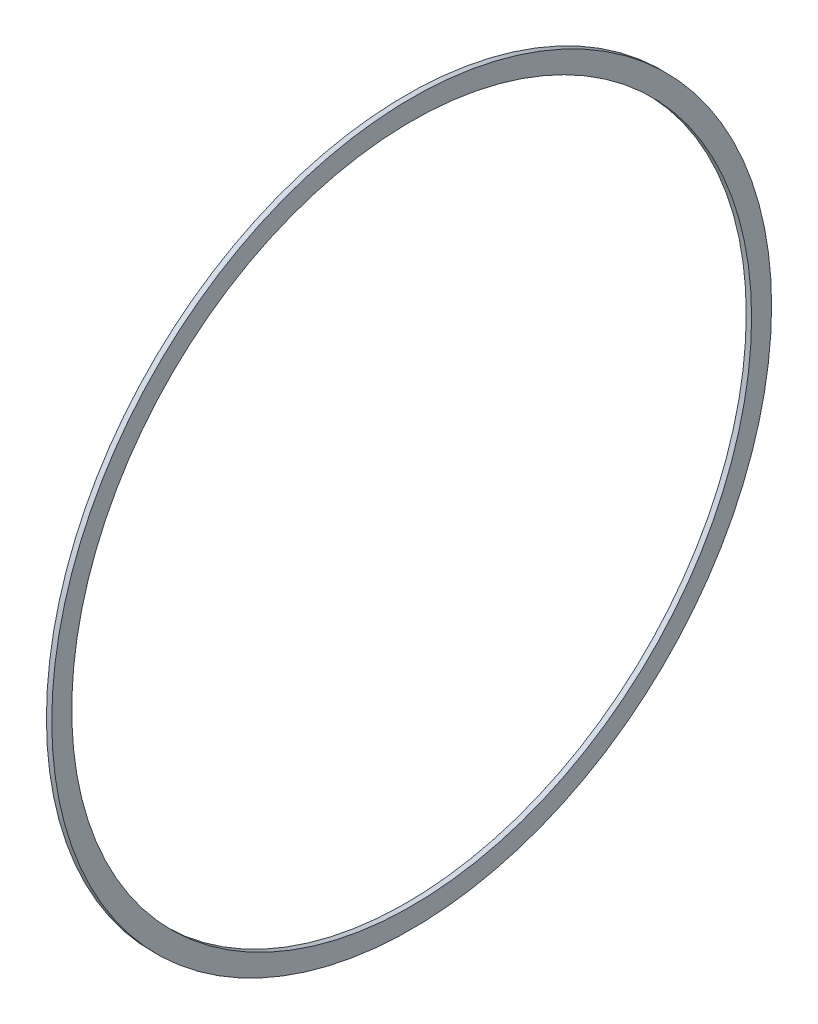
ISO-10303-21;
HEADER;
FILE_DESCRIPTION(('STEP AP214'),'2;1');
FILE_NAME('part.step','',(''),(''),'','','');
FILE_SCHEMA(('AUTOMOTIVE_DESIGN { 1 0 10303 214 1 1 1 1 }'));
ENDSEC;
DATA;
#1=APPLICATION_CONTEXT('core data for automotive mechanical design processes');
#2=APPLICATION_PROTOCOL_DEFINITION('international standard','automotive_design',2000,#1);
#3=PRODUCT_CONTEXT('',#1,'mechanical');
#4=PRODUCT('Part','Part','',(#3));
#5=PRODUCT_RELATED_PRODUCT_CATEGORY('part','',(#4));
#6=PRODUCT_DEFINITION_FORMATION('','',#4);
#7=PRODUCT_DEFINITION_CONTEXT('part definition',#1,'design');
#8=PRODUCT_DEFINITION('design','',#6,#7);
#9=PRODUCT_DEFINITION_SHAPE('','',#8);
#10=(LENGTH_UNIT() NAMED_UNIT(*) SI_UNIT(.MILLI.,.METRE.));
#11=(NAMED_UNIT(*) PLANE_ANGLE_UNIT() SI_UNIT($,.RADIAN.));
#12=(NAMED_UNIT(*) SI_UNIT($,.STERADIAN.) SOLID_ANGLE_UNIT());
#13=UNCERTAINTY_MEASURE_WITH_UNIT(LENGTH_MEASURE(1.E-05),#10,'distance_accuracy_value','');
#14=(GEOMETRIC_REPRESENTATION_CONTEXT(3) GLOBAL_UNCERTAINTY_ASSIGNED_CONTEXT((#13)) GLOBAL_UNIT_ASSIGNED_CONTEXT((#10,
#11,#12)) REPRESENTATION_CONTEXT('',''));
#15=CARTESIAN_POINT('',(0.,0.,0.));
#16=DIRECTION('',(0.,0.,1.));
#17=DIRECTION('',(1.,0.,0.));
#18=AXIS2_PLACEMENT_3D('',#15,#16,#17);
#19=CARTESIAN_POINT('',(0.,0.,0.));
#20=DIRECTION('',(1.,0.,0.));
#21=DIRECTION('',(0.,0.,-1.));
#22=AXIS2_PLACEMENT_3D('',#19,#20,#21);
#23=PLANE('',#22);
#24=CARTESIAN_POINT('',(0.,0.,0.));
#25=DIRECTION('',(1.,0.,0.));
#26=DIRECTION('',(0.,0.,-1.));
#27=AXIS2_PLACEMENT_3D('',#24,#25,#26);
#28=CIRCLE('',#27,127.5);
#29=CARTESIAN_POINT('',(0.,0.,-127.5));
#30=VERTEX_POINT('',#29);
#31=EDGE_CURVE('E42',#30,#30,#28,.T.);
#32=ORIENTED_EDGE('',*,*,#31,.T.);
#33=EDGE_LOOP('',(#32));
#34=FACE_BOUND('',#33,.T.);
#35=CARTESIAN_POINT('',(0.,0.,0.));
#36=DIRECTION('',(-1.,0.,0.));
#37=DIRECTION('',(0.,0.,1.));
#38=AXIS2_PLACEMENT_3D('',#35,#36,#37);
#39=CIRCLE('',#38,135.);
#40=CARTESIAN_POINT('',(0.,0.,135.));
#41=VERTEX_POINT('',#40);
#42=EDGE_CURVE('E10',#41,#41,#39,.T.);
#43=ORIENTED_EDGE('',*,*,#42,.T.);
#44=EDGE_LOOP('',(#43));
#45=FACE_BOUND('',#44,.T.);
#46=ADVANCED_FACE('F32',(#34,#45),#23,.F.);
#47=CARTESIAN_POINT('',(0.,0.,0.));
#48=DIRECTION('',(-1.,0.,0.));
#49=DIRECTION('',(0.,0.,1.));
#50=AXIS2_PLACEMENT_3D('',#47,#48,#49);
#51=CYLINDRICAL_SURFACE('',#50,135.);
#52=ORIENTED_EDGE('',*,*,#42,.F.);
#53=EDGE_LOOP('',(#52));
#54=FACE_BOUND('',#53,.T.);
#55=CARTESIAN_POINT('',(2.,0.,0.));
#56=DIRECTION('',(-1.,0.,0.));
#57=DIRECTION('',(0.,0.,1.));
#58=AXIS2_PLACEMENT_3D('',#55,#56,#57);
#59=CIRCLE('',#58,135.);
#60=CARTESIAN_POINT('',(2.,0.,135.));
#61=VERTEX_POINT('',#60);
#62=EDGE_CURVE('E38',#61,#61,#59,.T.);
#63=ORIENTED_EDGE('',*,*,#62,.T.);
#64=EDGE_LOOP('',(#63));
#65=FACE_BOUND('',#64,.T.);
#66=ADVANCED_FACE('F57',(#54,#65),#51,.T.);
#67=CARTESIAN_POINT('',(2.00000000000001,135.,0.));
#68=DIRECTION('',(-1.,0.,0.));
#69=DIRECTION('',(0.,0.,1.));
#70=AXIS2_PLACEMENT_3D('',#67,#68,#69);
#71=PLANE('',#70);
#72=CARTESIAN_POINT('',(2.00000000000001,0.,0.));
#73=DIRECTION('',(1.,0.,0.));
#74=DIRECTION('',(0.,0.,-1.));
#75=AXIS2_PLACEMENT_3D('',#72,#73,#74);
#76=CIRCLE('',#75,127.5);
#77=CARTESIAN_POINT('',(2.00000000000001,0.,-127.5));
#78=VERTEX_POINT('',#77);
#79=EDGE_CURVE('E46',#78,#78,#76,.T.);
#80=ORIENTED_EDGE('',*,*,#79,.F.);
#81=EDGE_LOOP('',(#80));
#82=FACE_BOUND('',#81,.T.);
#83=ORIENTED_EDGE('',*,*,#62,.F.);
#84=EDGE_LOOP('',(#83));
#85=FACE_BOUND('',#84,.T.);
#86=ADVANCED_FACE('F54',(#82,#85),#71,.F.);
#87=CARTESIAN_POINT('',(0.,0.,0.));
#88=DIRECTION('',(1.,0.,0.));
#89=DIRECTION('',(0.,0.,-1.));
#90=AXIS2_PLACEMENT_3D('',#87,#88,#89);
#91=CYLINDRICAL_SURFACE('',#90,127.5);
#92=ORIENTED_EDGE('',*,*,#31,.F.);
#93=EDGE_LOOP('',(#92));
#94=FACE_BOUND('',#93,.T.);
#95=ORIENTED_EDGE('',*,*,#79,.T.);
#96=EDGE_LOOP('',(#95));
#97=FACE_BOUND('',#96,.T.);
#98=ADVANCED_FACE('F52',(#94,#97),#91,.F.);
#99=CLOSED_SHELL('',(#46,#66,#86,#98));
#100=MANIFOLD_SOLID_BREP('B2',#99);
#101=ADVANCED_BREP_SHAPE_REPRESENTATION('',(#18,#100),#14);
#102=SHAPE_DEFINITION_REPRESENTATION(#9,#101);
ENDSEC;
END-ISO-10303-21;
